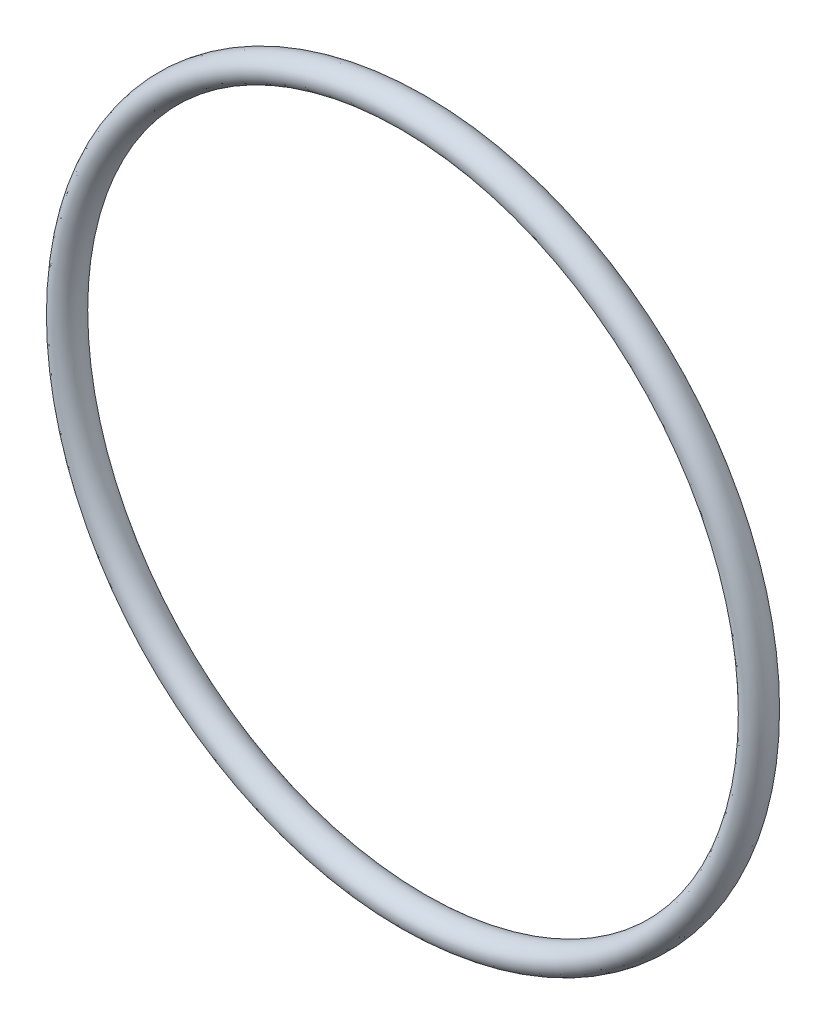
ISO-10303-21;
HEADER;
FILE_DESCRIPTION(('STEP AP214'),'2;1');
FILE_NAME('part.step','',(''),(''),'','','');
FILE_SCHEMA(('AUTOMOTIVE_DESIGN { 1 0 10303 214 1 1 1 1 }'));
ENDSEC;
DATA;
#1=APPLICATION_CONTEXT('core data for automotive mechanical design processes');
#2=APPLICATION_PROTOCOL_DEFINITION('international standard','automotive_design',2000,#1);
#3=PRODUCT_CONTEXT('',#1,'mechanical');
#4=PRODUCT('Part','Part','',(#3));
#5=PRODUCT_RELATED_PRODUCT_CATEGORY('part','',(#4));
#6=PRODUCT_DEFINITION_FORMATION('','',#4);
#7=PRODUCT_DEFINITION_CONTEXT('part definition',#1,'design');
#8=PRODUCT_DEFINITION('design','',#6,#7);
#9=PRODUCT_DEFINITION_SHAPE('','',#8);
#10=(LENGTH_UNIT() NAMED_UNIT(*) SI_UNIT(.MILLI.,.METRE.));
#11=(NAMED_UNIT(*) PLANE_ANGLE_UNIT() SI_UNIT($,.RADIAN.));
#12=(NAMED_UNIT(*) SI_UNIT($,.STERADIAN.) SOLID_ANGLE_UNIT());
#13=UNCERTAINTY_MEASURE_WITH_UNIT(LENGTH_MEASURE(1.E-05),#10,'distance_accuracy_value','');
#14=(GEOMETRIC_REPRESENTATION_CONTEXT(3) GLOBAL_UNCERTAINTY_ASSIGNED_CONTEXT((#13)) GLOBAL_UNIT_ASSIGNED_CONTEXT((#10,
#11,#12)) REPRESENTATION_CONTEXT('',''));
#15=CARTESIAN_POINT('',(0.,0.,0.));
#16=DIRECTION('',(0.,0.,1.));
#17=DIRECTION('',(1.,0.,0.));
#18=AXIS2_PLACEMENT_3D('',#15,#16,#17);
#19=CARTESIAN_POINT('',(0.,20.8,-0.950000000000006));
#20=DIRECTION('',(1.,0.,0.));
#21=DIRECTION('',(0.,0.,-1.));
#22=AXIS2_PLACEMENT_3D('',#19,#20,#21);
#23=ELLIPSE('',#22,0.95,0.799999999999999);
#24=CARTESIAN_POINT('',(0.,0.,0.));
#25=DIRECTION('',(0.,0.,1.));
#26=AXIS1_PLACEMENT('',#24,#25);
#27=SURFACE_OF_REVOLUTION('',#23,#26);
#28=ADVANCED_FACE('F26',(),#27,.T.);
#29=CLOSED_SHELL('',(#28));
#30=MANIFOLD_SOLID_BREP('B2',#29);
#31=ADVANCED_BREP_SHAPE_REPRESENTATION('',(#18,#30),#14);
#32=SHAPE_DEFINITION_REPRESENTATION(#9,#31);
ENDSEC;
END-ISO-10303-21;
